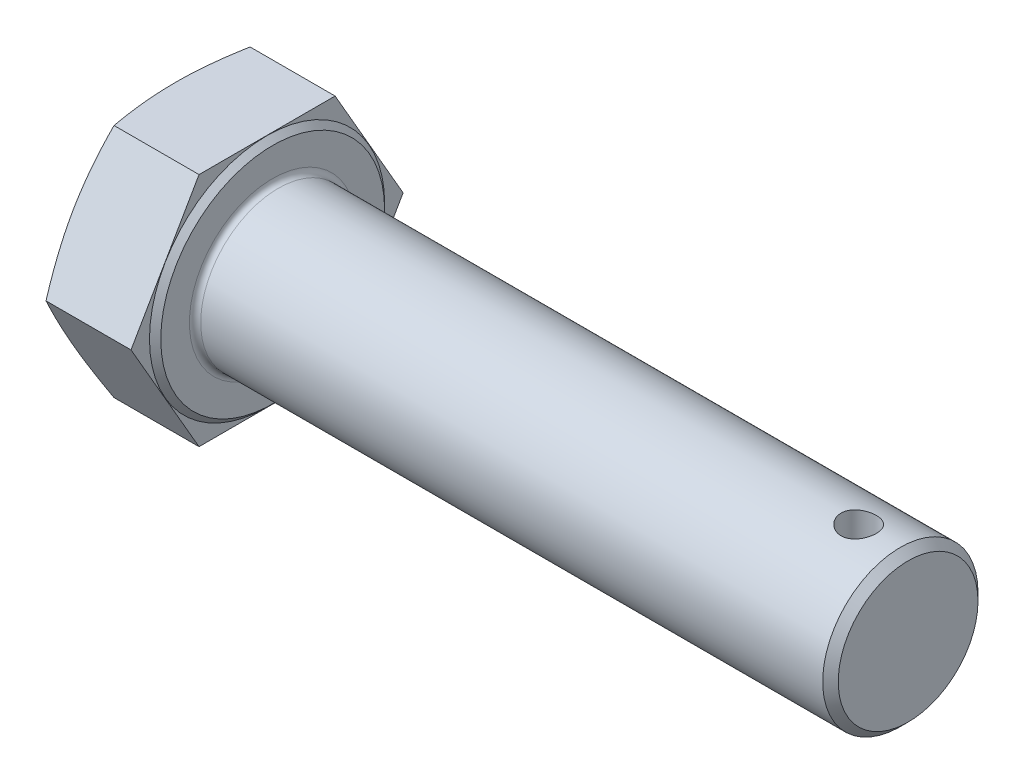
from build123d import *

# Parameters (mm, degrees)
BASEHEAD_DEPTH  = 13.78
SKETCH5_R       = 11
BASEBODY_DEPTH  = 90
CHAMFER1_SIZE   = 1.1
HOLE_DEPTH      = 107.86558208
HOLE_DEPTH_BACK = 107.86558208
SKETCH6_R       = 2.5
HEADFILLET_R    = 0.8


with BuildPart() as part:
    # Sketch2 → BaseHead (new body)
    with BuildSketch(Plane(origin=(0, 0, 0), x_dir=(0, 0, -1), z_dir=(1, 0, 0))):
        Polygon((19.271951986, 0), (9.635975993, 16.69), (-9.635975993, 16.69), (-19.271951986, 0), (-9.635975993, -16.69), (9.635975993, -16.69), align=None)
    extrude(amount=BASEHEAD_DEPTH)

    # Sketch3 → BearingFace (revolve, cut)
    with BuildSketch(Plane(origin=(0, 0, 0), x_dir=(1, 0, 0), z_dir=(0, 1, 0)), mode=Mode.PRIVATE) as bearingface_sk:
        Polygon((13.78, 19.271951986), (13.78, 15.855), (12.98, 16.655), (12.98, 19.271951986), align=None)
    revolve(bearingface_sk.sketch.rotate(Axis((-0.957090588, 0, 0), (1, 0, 0)), 180), axis=Axis((-0.957090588, 0, 0), (1, 0, 0)), mode=Mode.SUBTRACT)

    # Sketch4 → HeadChamfer (revolve, cut)
    with BuildSketch(Plane(origin=(0, 0, 0), x_dir=(1, 0, 0), z_dir=(0, 1, 0))):
        Polygon((0, 19.271951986), (0.939753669, 19.271951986), (0, 16.69), align=None)
    revolve(axis=Axis((-0.493528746, 0, 0), (1, 0, 0)), mode=Mode.SUBTRACT)

    # Sketch5 → BaseBody (add)
    with BuildSketch(Plane(origin=(13.78, 0, 0), x_dir=(0, 0, -1), z_dir=(1, 0, 0))):
        with Locations(Location((0, 0, 0), (0, 0, 180))):
            Circle(SKETCH5_R)
    extrude(amount=BASEBODY_DEPTH)

    # Chamfer1
    chamfer1_edges = [part.edges().sort_by_distance(p)[0] for p in [
        (103.78, 0, -11),
    ]]
    chamfer(chamfer1_edges, length=CHAMFER1_SIZE)

    # Sketch6 → Hole (cut, two sides: drawn at the far end of the back side and taken through both)
    with BuildSketch(Plane(origin=(0, 0, 0), x_dir=(1, 0, 0), z_dir=(0, 1, 0)).offset(-HOLE_DEPTH_BACK)):
        with Locations(Location((96.78, 0, 0), (0, 0, 270))):
            Circle(SKETCH6_R)
    extrude(amount=HOLE_DEPTH + HOLE_DEPTH_BACK, mode=Mode.SUBTRACT)

    # HeadFillet
    headfillet_edges = [part.edges().sort_by_distance(p)[0] for p in [
        (13.78, 0, -11),
    ]]
    fillet(headfillet_edges, radius=HEADFILLET_R)


solid = part.part
